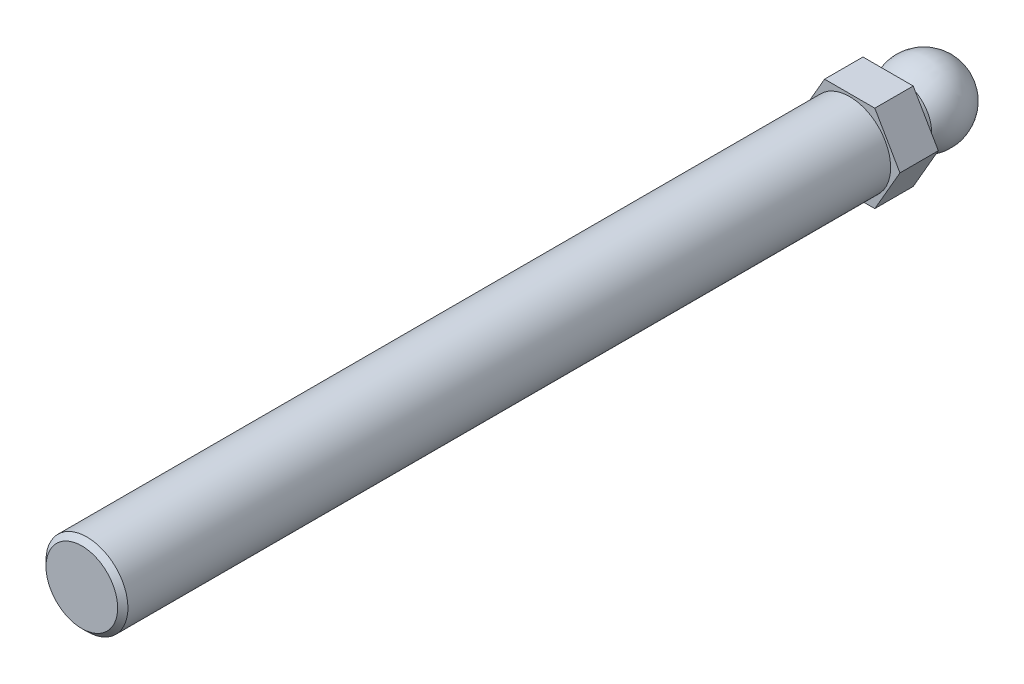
ISO-10303-21;
HEADER;
FILE_DESCRIPTION(('STEP AP214'),'2;1');
FILE_NAME('part.step','',(''),(''),'','','');
FILE_SCHEMA(('AUTOMOTIVE_DESIGN { 1 0 10303 214 1 1 1 1 }'));
ENDSEC;
DATA;
#1=APPLICATION_CONTEXT('core data for automotive mechanical design processes');
#2=APPLICATION_PROTOCOL_DEFINITION('international standard','automotive_design',2000,#1);
#3=PRODUCT_CONTEXT('',#1,'mechanical');
#4=PRODUCT('Part','Part','',(#3));
#5=PRODUCT_RELATED_PRODUCT_CATEGORY('part','',(#4));
#6=PRODUCT_DEFINITION_FORMATION('','',#4);
#7=PRODUCT_DEFINITION_CONTEXT('part definition',#1,'design');
#8=PRODUCT_DEFINITION('design','',#6,#7);
#9=PRODUCT_DEFINITION_SHAPE('','',#8);
#10=(LENGTH_UNIT() NAMED_UNIT(*) SI_UNIT(.MILLI.,.METRE.));
#11=(NAMED_UNIT(*) PLANE_ANGLE_UNIT() SI_UNIT($,.RADIAN.));
#12=(NAMED_UNIT(*) SI_UNIT($,.STERADIAN.) SOLID_ANGLE_UNIT());
#13=UNCERTAINTY_MEASURE_WITH_UNIT(LENGTH_MEASURE(1.E-05),#10,'distance_accuracy_value','');
#14=(GEOMETRIC_REPRESENTATION_CONTEXT(3) GLOBAL_UNCERTAINTY_ASSIGNED_CONTEXT((#13)) GLOBAL_UNIT_ASSIGNED_CONTEXT((#10,
#11,#12)) REPRESENTATION_CONTEXT('',''));
#15=CARTESIAN_POINT('',(0.,0.,0.));
#16=DIRECTION('',(0.,0.,1.));
#17=DIRECTION('',(1.,0.,0.));
#18=AXIS2_PLACEMENT_3D('',#15,#16,#17);
#19=CARTESIAN_POINT('',(0.,0.,0.));
#20=DIRECTION('',(1.,0.,0.));
#21=DIRECTION('',(0.,1.,0.));
#22=AXIS2_PLACEMENT_3D('',#19,#20,#21);
#23=SPHERICAL_SURFACE('',#22,7.5);
#24=CARTESIAN_POINT('',(-7.5,0.,0.));
#25=VERTEX_POINT('',#24);
#26=VERTEX_LOOP('',#25);
#27=FACE_BOUND('',#26,.T.);
#28=CARTESIAN_POINT('',(7.5,0.,0.));
#29=VERTEX_POINT('',#28);
#30=VERTEX_LOOP('',#29);
#31=FACE_BOUND('',#30,.T.);
#32=CARTESIAN_POINT('',(0.,0.,4.5));
#33=DIRECTION('',(0.,0.,1.));
#34=DIRECTION('',(1.,0.,0.));
#35=AXIS2_PLACEMENT_3D('',#32,#33,#34);
#36=CIRCLE('',#35,6.);
#37=CARTESIAN_POINT('',(6.,0.,4.5));
#38=VERTEX_POINT('',#37);
#39=EDGE_CURVE('E20',#38,#38,#36,.T.);
#40=ORIENTED_EDGE('',*,*,#39,.F.);
#41=EDGE_LOOP('',(#40));
#42=FACE_BOUND('',#41,.T.);
#43=ADVANCED_FACE('F16',(#27,#31,#42),#23,.T.);
#44=CARTESIAN_POINT('',(0.,0.,0.));
#45=DIRECTION('',(0.,0.,1.));
#46=DIRECTION('',(1.,0.,0.));
#47=AXIS2_PLACEMENT_3D('',#44,#45,#46);
#48=CYLINDRICAL_SURFACE('',#47,6.);
#49=ORIENTED_EDGE('',*,*,#39,.T.);
#50=EDGE_LOOP('',(#49));
#51=FACE_BOUND('',#50,.T.);
#52=CARTESIAN_POINT('',(0.,0.,7.));
#53=DIRECTION('',(0.,0.,1.));
#54=DIRECTION('',(1.,0.,0.));
#55=AXIS2_PLACEMENT_3D('',#52,#53,#54);
#56=CIRCLE('',#55,6.);
#57=CARTESIAN_POINT('',(6.,0.,7.));
#58=VERTEX_POINT('',#57);
#59=EDGE_CURVE('E79',#58,#58,#56,.F.);
#60=ORIENTED_EDGE('',*,*,#59,.T.);
#61=EDGE_LOOP('',(#60));
#62=FACE_BOUND('',#61,.T.);
#63=ADVANCED_FACE('F74',(#51,#62),#48,.T.);
#64=CARTESIAN_POINT('',(0.,0.,7.));
#65=DIRECTION('',(0.,0.,1.));
#66=DIRECTION('',(1.,0.,0.));
#67=AXIS2_PLACEMENT_3D('',#64,#65,#66);
#68=PLANE('',#67);
#69=ORIENTED_EDGE('',*,*,#59,.F.);
#70=EDGE_LOOP('',(#69));
#71=FACE_BOUND('',#70,.T.);
#72=DIRECTION('',(-0.5,0.866025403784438,0.));
#73=VECTOR('',#72,1.);
#74=CARTESIAN_POINT('',(4.90747728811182,8.5,7.));
#75=LINE('',#74,#73);
#76=CARTESIAN_POINT('',(9.81495457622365,0.,7.));
#77=VERTEX_POINT('',#76);
#78=CARTESIAN_POINT('',(4.90747728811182,8.5,7.));
#79=VERTEX_POINT('',#78);
#80=EDGE_CURVE('E81',#77,#79,#75,.T.);
#81=ORIENTED_EDGE('',*,*,#80,.F.);
#82=DIRECTION('',(0.5,0.866025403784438,0.));
#83=VECTOR('',#82,1.);
#84=CARTESIAN_POINT('',(9.81495457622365,0.,7.));
#85=LINE('',#84,#83);
#86=CARTESIAN_POINT('',(4.90747728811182,-8.5,7.));
#87=VERTEX_POINT('',#86);
#88=EDGE_CURVE('E114',#87,#77,#85,.T.);
#89=ORIENTED_EDGE('',*,*,#88,.F.);
#90=DIRECTION('',(1.,0.,0.));
#91=VECTOR('',#90,1.);
#92=CARTESIAN_POINT('',(4.90747728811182,-8.5,7.));
#93=LINE('',#92,#91);
#94=CARTESIAN_POINT('',(-4.90747728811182,-8.5,7.));
#95=VERTEX_POINT('',#94);
#96=EDGE_CURVE('E111',#95,#87,#93,.T.);
#97=ORIENTED_EDGE('',*,*,#96,.F.);
#98=DIRECTION('',(0.5,-0.866025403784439,0.));
#99=VECTOR('',#98,1.);
#100=CARTESIAN_POINT('',(-4.90747728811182,-8.5,7.));
#101=LINE('',#100,#99);
#102=CARTESIAN_POINT('',(-9.81495457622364,0.,7.));
#103=VERTEX_POINT('',#102);
#104=EDGE_CURVE('E106',#103,#95,#101,.T.);
#105=ORIENTED_EDGE('',*,*,#104,.F.);
#106=DIRECTION('',(-0.5,-0.866025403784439,0.));
#107=VECTOR('',#106,1.);
#108=CARTESIAN_POINT('',(-9.81495457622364,0.,7.));
#109=LINE('',#108,#107);
#110=CARTESIAN_POINT('',(-4.90747728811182,8.5,7.));
#111=VERTEX_POINT('',#110);
#112=EDGE_CURVE('E101',#111,#103,#109,.T.);
#113=ORIENTED_EDGE('',*,*,#112,.F.);
#114=DIRECTION('',(1.,0.,0.));
#115=VECTOR('',#114,1.);
#116=CARTESIAN_POINT('',(-4.90747728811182,8.5,7.));
#117=LINE('',#116,#115);
#118=EDGE_CURVE('E96',#79,#111,#117,.F.);
#119=ORIENTED_EDGE('',*,*,#118,.F.);
#120=EDGE_LOOP('',(#81,#89,#97,#105,#113,#119));
#121=FACE_BOUND('',#120,.T.);
#122=ADVANCED_FACE('F235',(#71,#121),#68,.F.);
#123=CARTESIAN_POINT('',(4.90747728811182,8.5,7.));
#124=DIRECTION('',(0.866025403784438,0.5,0.));
#125=DIRECTION('',(-0.5,0.866025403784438,0.));
#126=AXIS2_PLACEMENT_3D('',#123,#124,#125);
#127=PLANE('',#126);
#128=ORIENTED_EDGE('',*,*,#80,.T.);
#129=DIRECTION('',(0.,0.,1.));
#130=VECTOR('',#129,1.);
#131=CARTESIAN_POINT('',(4.90747728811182,8.5,7.));
#132=LINE('',#131,#130);
#133=CARTESIAN_POINT('',(4.90747728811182,8.5,14.5));
#134=VERTEX_POINT('',#133);
#135=EDGE_CURVE('E84',#134,#79,#132,.F.);
#136=ORIENTED_EDGE('',*,*,#135,.F.);
#137=DIRECTION('',(-0.500000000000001,0.866025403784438,0.));
#138=VECTOR('',#137,1.);
#139=CARTESIAN_POINT('',(9.81495457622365,0.,14.5));
#140=LINE('',#139,#138);
#141=CARTESIAN_POINT('',(9.81495457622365,0.,14.5));
#142=VERTEX_POINT('',#141);
#143=EDGE_CURVE('E120',#142,#134,#140,.T.);
#144=ORIENTED_EDGE('',*,*,#143,.F.);
#145=DIRECTION('',(0.,0.,1.));
#146=VECTOR('',#145,1.);
#147=CARTESIAN_POINT('',(9.81495457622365,0.,7.));
#148=LINE('',#147,#146);
#149=EDGE_CURVE('E117',#77,#142,#148,.T.);
#150=ORIENTED_EDGE('',*,*,#149,.F.);
#151=EDGE_LOOP('',(#128,#136,#144,#150));
#152=FACE_BOUND('',#151,.T.);
#153=ADVANCED_FACE('F145',(#152),#127,.T.);
#154=CARTESIAN_POINT('',(-4.90747728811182,8.5,7.));
#155=DIRECTION('',(0.,1.,0.));
#156=DIRECTION('',(0.,0.,1.));
#157=AXIS2_PLACEMENT_3D('',#154,#155,#156);
#158=PLANE('',#157);
#159=ORIENTED_EDGE('',*,*,#118,.T.);
#160=DIRECTION('',(0.,0.,1.));
#161=VECTOR('',#160,1.);
#162=CARTESIAN_POINT('',(-4.90747728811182,8.5,7.));
#163=LINE('',#162,#161);
#164=CARTESIAN_POINT('',(-4.90747728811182,8.5,14.5));
#165=VERTEX_POINT('',#164);
#166=EDGE_CURVE('E98',#165,#111,#163,.F.);
#167=ORIENTED_EDGE('',*,*,#166,.F.);
#168=DIRECTION('',(1.,0.,0.));
#169=VECTOR('',#168,1.);
#170=CARTESIAN_POINT('',(0.,8.5,14.5));
#171=LINE('',#170,#169);
#172=EDGE_CURVE('E123',#134,#165,#171,.F.);
#173=ORIENTED_EDGE('',*,*,#172,.F.);
#174=ORIENTED_EDGE('',*,*,#135,.T.);
#175=EDGE_LOOP('',(#159,#167,#173,#174));
#176=FACE_BOUND('',#175,.T.);
#177=ADVANCED_FACE('F149',(#176),#158,.T.);
#178=CARTESIAN_POINT('',(-9.81495457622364,0.,7.));
#179=DIRECTION('',(-0.866025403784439,0.5,0.));
#180=DIRECTION('',(-0.5,-0.866025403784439,0.));
#181=AXIS2_PLACEMENT_3D('',#178,#179,#180);
#182=PLANE('',#181);
#183=ORIENTED_EDGE('',*,*,#112,.T.);
#184=DIRECTION('',(0.,0.,1.));
#185=VECTOR('',#184,1.);
#186=CARTESIAN_POINT('',(-9.81495457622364,0.,7.));
#187=LINE('',#186,#185);
#188=CARTESIAN_POINT('',(-9.81495457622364,0.,14.5));
#189=VERTEX_POINT('',#188);
#190=EDGE_CURVE('E103',#189,#103,#187,.F.);
#191=ORIENTED_EDGE('',*,*,#190,.F.);
#192=DIRECTION('',(-0.5,-0.866025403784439,0.));
#193=VECTOR('',#192,1.);
#194=CARTESIAN_POINT('',(-4.90747728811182,8.5,14.5));
#195=LINE('',#194,#193);
#196=EDGE_CURVE('E126',#165,#189,#195,.T.);
#197=ORIENTED_EDGE('',*,*,#196,.F.);
#198=ORIENTED_EDGE('',*,*,#166,.T.);
#199=EDGE_LOOP('',(#183,#191,#197,#198));
#200=FACE_BOUND('',#199,.T.);
#201=ADVANCED_FACE('F153',(#200),#182,.T.);
#202=CARTESIAN_POINT('',(-4.90747728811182,-8.5,7.));
#203=DIRECTION('',(-0.866025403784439,-0.5,0.));
#204=DIRECTION('',(0.5,-0.866025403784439,0.));
#205=AXIS2_PLACEMENT_3D('',#202,#203,#204);
#206=PLANE('',#205);
#207=ORIENTED_EDGE('',*,*,#104,.T.);
#208=DIRECTION('',(0.,0.,-1.));
#209=VECTOR('',#208,1.);
#210=CARTESIAN_POINT('',(-4.90747728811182,-8.5,7.));
#211=LINE('',#210,#209);
#212=CARTESIAN_POINT('',(-4.90747728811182,-8.5,14.5));
#213=VERTEX_POINT('',#212);
#214=EDGE_CURVE('E108',#213,#95,#211,.T.);
#215=ORIENTED_EDGE('',*,*,#214,.F.);
#216=DIRECTION('',(0.5,-0.866025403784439,0.));
#217=VECTOR('',#216,1.);
#218=CARTESIAN_POINT('',(-9.81495457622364,0.,14.5));
#219=LINE('',#218,#217);
#220=EDGE_CURVE('E129',#189,#213,#219,.T.);
#221=ORIENTED_EDGE('',*,*,#220,.F.);
#222=ORIENTED_EDGE('',*,*,#190,.T.);
#223=EDGE_LOOP('',(#207,#215,#221,#222));
#224=FACE_BOUND('',#223,.T.);
#225=ADVANCED_FACE('F157',(#224),#206,.T.);
#226=CARTESIAN_POINT('',(4.90747728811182,-8.5,7.));
#227=DIRECTION('',(0.,-1.,0.));
#228=DIRECTION('',(0.,0.,-1.));
#229=AXIS2_PLACEMENT_3D('',#226,#227,#228);
#230=PLANE('',#229);
#231=ORIENTED_EDGE('',*,*,#96,.T.);
#232=DIRECTION('',(0.,0.,1.));
#233=VECTOR('',#232,1.);
#234=CARTESIAN_POINT('',(4.90747728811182,-8.5,7.));
#235=LINE('',#234,#233);
#236=CARTESIAN_POINT('',(4.90747728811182,-8.5,14.5));
#237=VERTEX_POINT('',#236);
#238=EDGE_CURVE('E35',#237,#87,#235,.F.);
#239=ORIENTED_EDGE('',*,*,#238,.F.);
#240=DIRECTION('',(1.,0.,0.));
#241=VECTOR('',#240,1.);
#242=CARTESIAN_POINT('',(0.,-8.5,14.5));
#243=LINE('',#242,#241);
#244=EDGE_CURVE('E132',#213,#237,#243,.T.);
#245=ORIENTED_EDGE('',*,*,#244,.F.);
#246=ORIENTED_EDGE('',*,*,#214,.T.);
#247=EDGE_LOOP('',(#231,#239,#245,#246));
#248=FACE_BOUND('',#247,.T.);
#249=ADVANCED_FACE('F159',(#248),#230,.T.);
#250=CARTESIAN_POINT('',(9.81495457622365,0.,7.));
#251=DIRECTION('',(0.866025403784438,-0.5,0.));
#252=DIRECTION('',(0.5,0.866025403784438,0.));
#253=AXIS2_PLACEMENT_3D('',#250,#251,#252);
#254=PLANE('',#253);
#255=ORIENTED_EDGE('',*,*,#88,.T.);
#256=ORIENTED_EDGE('',*,*,#149,.T.);
#257=DIRECTION('',(0.5,0.866025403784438,0.));
#258=VECTOR('',#257,1.);
#259=CARTESIAN_POINT('',(4.90747728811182,-8.5,14.5));
#260=LINE('',#259,#258);
#261=EDGE_CURVE('E90',#237,#142,#260,.T.);
#262=ORIENTED_EDGE('',*,*,#261,.F.);
#263=ORIENTED_EDGE('',*,*,#238,.T.);
#264=EDGE_LOOP('',(#255,#256,#262,#263));
#265=FACE_BOUND('',#264,.T.);
#266=ADVANCED_FACE('F141',(#265),#254,.T.);
#267=CARTESIAN_POINT('',(0.,0.,164.5));
#268=DIRECTION('',(0.,0.,-1.));
#269=DIRECTION('',(-1.,0.,0.));
#270=AXIS2_PLACEMENT_3D('',#267,#268,#269);
#271=PLANE('',#270);
#272=CARTESIAN_POINT('',(0.,0.,164.500000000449));
#273=DIRECTION('',(0.,0.,-1.));
#274=DIRECTION('',(-1.,0.,0.));
#275=AXIS2_PLACEMENT_3D('',#272,#273,#274);
#276=CIRCLE('',#275,7.00000000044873);
#277=CARTESIAN_POINT('',(-7.00000000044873,0.,164.500000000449));
#278=VERTEX_POINT('',#277);
#279=EDGE_CURVE('E87',#278,#278,#276,.T.);
#280=ORIENTED_EDGE('',*,*,#279,.F.);
#281=EDGE_LOOP('',(#280));
#282=FACE_BOUND('',#281,.T.);
#283=ADVANCED_FACE('F167',(#282),#271,.F.);
#284=CARTESIAN_POINT('',(0.,0.,14.5));
#285=DIRECTION('',(0.,0.,1.));
#286=DIRECTION('',(1.,0.,0.));
#287=AXIS2_PLACEMENT_3D('',#284,#285,#286);
#288=PLANE('',#287);
#289=CARTESIAN_POINT('',(0.,0.,14.5));
#290=DIRECTION('',(0.,0.,1.));
#291=DIRECTION('',(0.,-1.,0.));
#292=AXIS2_PLACEMENT_3D('',#289,#290,#291);
#293=CIRCLE('',#292,8.);
#294=CARTESIAN_POINT('',(0.,-8.,14.5));
#295=VERTEX_POINT('',#294);
#296=EDGE_CURVE('E26',#295,#295,#293,.T.);
#297=ORIENTED_EDGE('',*,*,#296,.F.);
#298=EDGE_LOOP('',(#297));
#299=FACE_BOUND('',#298,.T.);
#300=ORIENTED_EDGE('',*,*,#244,.T.);
#301=ORIENTED_EDGE('',*,*,#261,.T.);
#302=ORIENTED_EDGE('',*,*,#143,.T.);
#303=ORIENTED_EDGE('',*,*,#172,.T.);
#304=ORIENTED_EDGE('',*,*,#196,.T.);
#305=ORIENTED_EDGE('',*,*,#220,.T.);
#306=EDGE_LOOP('',(#300,#301,#302,#303,#304,#305));
#307=FACE_BOUND('',#306,.T.);
#308=ADVANCED_FACE('F139',(#299,#307),#288,.T.);
#309=CARTESIAN_POINT('',(0.,0.,163.499999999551));
#310=DIRECTION('',(0.,0.,-1.));
#311=DIRECTION('',(-1.,0.,0.));
#312=AXIS2_PLACEMENT_3D('',#309,#310,#311);
#313=CONICAL_SURFACE('',#312,7.99999999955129,0.785398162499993);
#314=CARTESIAN_POINT('',(0.,0.,163.5));
#315=DIRECTION('',(0.,0.,1.));
#316=DIRECTION('',(0.,-1.,0.));
#317=AXIS2_PLACEMENT_3D('',#314,#315,#316);
#318=CIRCLE('',#317,8.);
#319=CARTESIAN_POINT('',(0.,-8.,163.5));
#320=VERTEX_POINT('',#319);
#321=EDGE_CURVE('E11',#320,#320,#318,.F.);
#322=ORIENTED_EDGE('',*,*,#321,.F.);
#323=EDGE_LOOP('',(#322));
#324=FACE_BOUND('',#323,.T.);
#325=ORIENTED_EDGE('',*,*,#279,.T.);
#326=EDGE_LOOP('',(#325));
#327=FACE_BOUND('',#326,.T.);
#328=ADVANCED_FACE('F172',(#324,#327),#313,.T.);
#329=CARTESIAN_POINT('',(0.,0.,14.5));
#330=DIRECTION('',(0.,0.,1.));
#331=DIRECTION('',(0.,-1.,0.));
#332=AXIS2_PLACEMENT_3D('',#329,#330,#331);
#333=CYLINDRICAL_SURFACE('',#332,8.);
#334=ORIENTED_EDGE('',*,*,#321,.T.);
#335=EDGE_LOOP('',(#334));
#336=FACE_BOUND('',#335,.T.);
#337=ORIENTED_EDGE('',*,*,#296,.T.);
#338=EDGE_LOOP('',(#337));
#339=FACE_BOUND('',#338,.T.);
#340=ADVANCED_FACE('F170',(#336,#339),#333,.T.);
#341=CLOSED_SHELL('',(#43,#63,#122,#153,#177,#201,#225,#249,#266,#283,#308,#328,#340));
#342=MANIFOLD_SOLID_BREP('B1',#341);
#343=ADVANCED_BREP_SHAPE_REPRESENTATION('',(#18,#342),#14);
#344=SHAPE_DEFINITION_REPRESENTATION(#9,#343);
ENDSEC;
END-ISO-10303-21;
